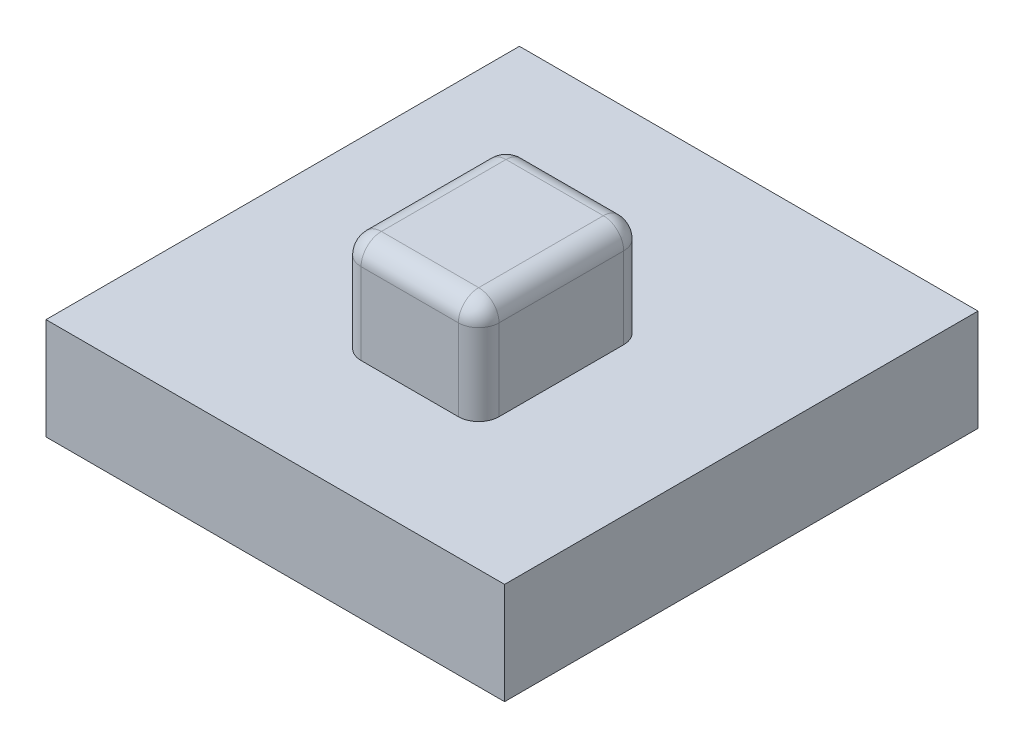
from build123d import *

# Parameters (mm, degrees)
SKETCH1_W      = 45.126285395
SKETCH1_H      = 46.585565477
EXTRUDE1_DEPTH = 10
SKETCH2_W      = 13.577973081
SKETCH2_H      = 16.264770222
EXTRUDE2_DEPTH = 10
FILLET1_R      = 2


with BuildPart() as part:
    # Sketch1 → Extrude1 (new body)
    with BuildSketch(Plane(origin=(0, 0, 0), x_dir=(1, 0, 0), z_dir=(0, 1, 0))):
        with Locations((-41.677535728, 8.192633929)):
            Rectangle(SKETCH1_W, SKETCH1_H)
    extrude(amount=EXTRUDE1_DEPTH)

    # Sketch2 → Extrude2 (add)
    with BuildSketch(Plane(origin=(0, 10, 0), x_dir=(1, 0, 0), z_dir=(0, 1, 0))):
        with Locations((-40.462873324, 5.046109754)):
            Rectangle(SKETCH2_W, SKETCH2_H)
    extrude(amount=EXTRUDE2_DEPTH)

    # Fillet1
    fillet1_edges = [part.edges().sort_by_distance(p)[0] for p in [
        (-47.251859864, 15, -13.178494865),
        (-47.251859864, 15, 3.086275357),
        (-33.673886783, 15, 3.086275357),
        (-33.673886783, 15, -13.178494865),
        (-47.251859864, 20, -5.046109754),
        (-40.462873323, 20, 3.086275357),
        (-33.673886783, 20, -5.046109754),
        (-40.462873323, 20, -13.178494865),
    ]]
    fillet(fillet1_edges, radius=FILLET1_R)


solid = part.part
